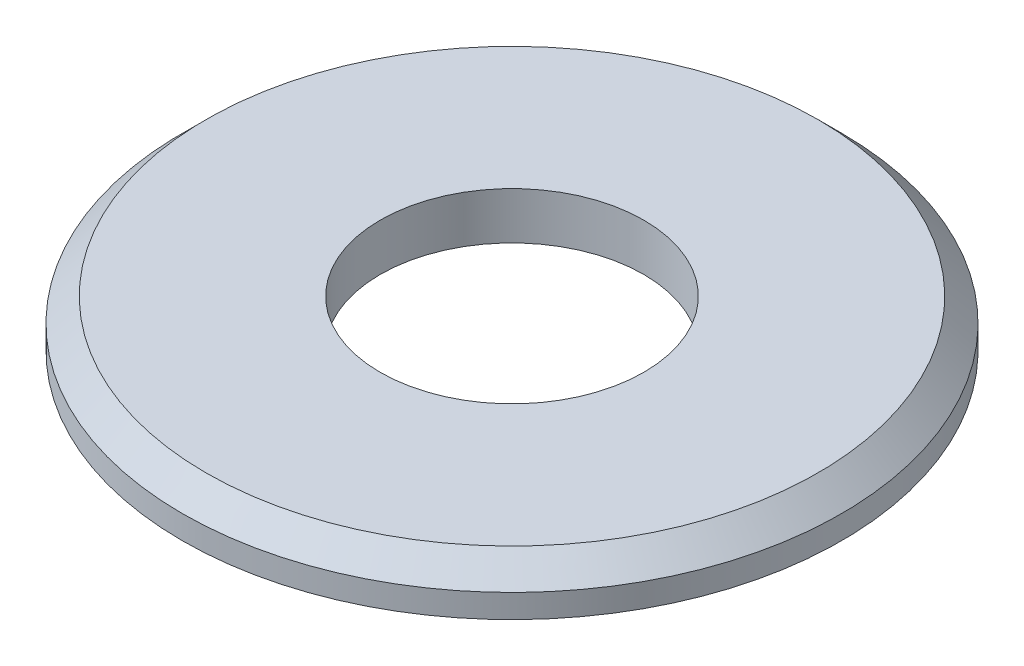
from build123d import *

# Parameters (mm, degrees)
SKETCH1_R      = 3.5
SKETCH1_R_2    = 1.4
EXTRUDE1_DEPTH = 0.5
CHAMFER1_SIZE  = 0.25


with BuildPart() as part:
    # Sketch1 → Extrude1 (new body)
    with BuildSketch(Plane(origin=(0, 0, 0), x_dir=(1, 0, 0), z_dir=(0, 1, 0))):
        with Locations(Location((0, 0, 0), (0, 0, 270))):
            Circle(SKETCH1_R)
        with Locations(Location((0, 0, 0), (0, 0, 270))):
            Circle(SKETCH1_R_2, mode=Mode.SUBTRACT)
    extrude(amount=EXTRUDE1_DEPTH)

    # Chamfer1
    chamfer1_edges = [part.edges().sort_by_distance(p)[0] for p in [
        (0, 0.5, -3.5),
    ]]
    chamfer(chamfer1_edges, length=CHAMFER1_SIZE)


solid = part.part
